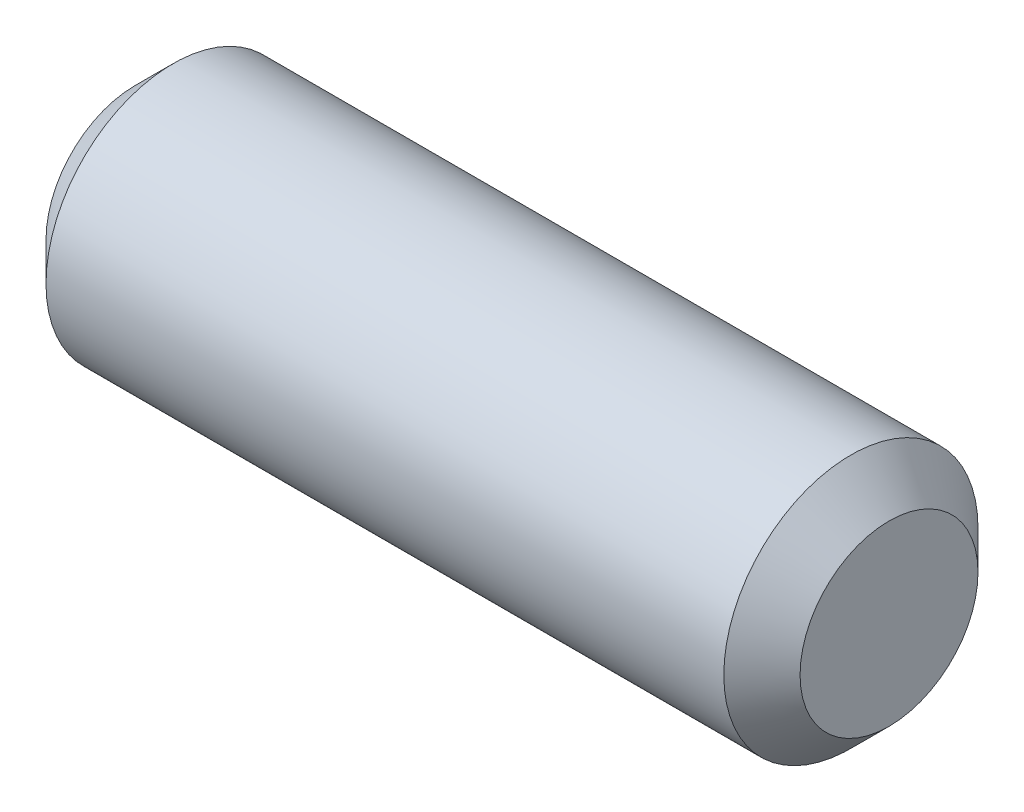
from build123d import *


with BuildPart() as part:
    # Skizze2 → Rotation1 (revolve)
    with BuildSketch(Plane.XY, mode=Mode.PRIVATE) as rotation1_sk:
        Polygon((-8.9, 0), (-8.9, 2.1), (-8, 3), (8, 3), (8.9, 2.1), (8.9, 0), align=None)
    revolve(rotation1_sk.sketch.rotate(Axis((-15.457134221, 0, 0), (1, 0, 0)), 90), axis=Axis((-15.457134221, 0, 0), (1, 0, 0)))


solid = part.part
